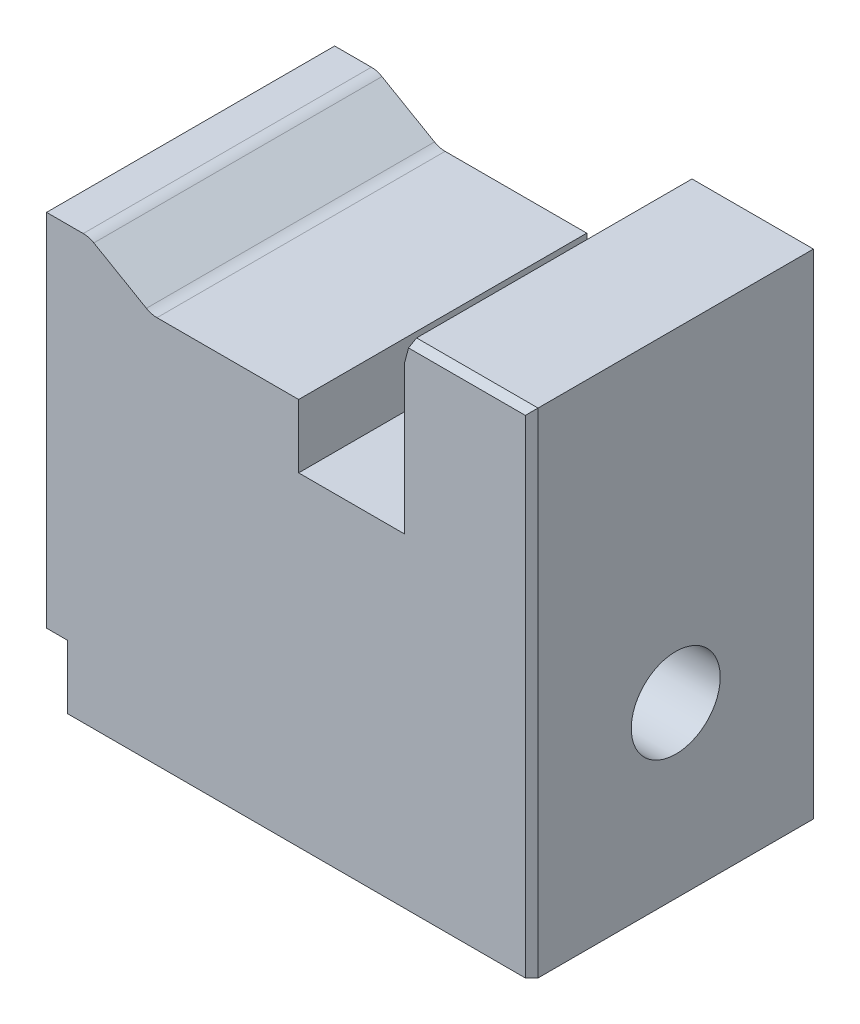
from build123d import *

# Parameters (mm, degrees)
EXTRUDE_1_DEPTH     = 13.6
M5X0_8_1_D          = 4.2
M5X0_8_1_DEPTH      = 12.4
M5X0_8_1_TIP        = 1.2618073
CHAMFER_1_SIZE      = 0.3
CHAMFER_2_SIZE      = 1
CHAMFER_2_SIZE2     = 0.267949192
SKETCH_12_W         = 21.621453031
SKETCH_12_H         = 9.517840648
CUT_EXTRUDE_7_DEPTH = 1


with BuildPart() as part:
    # Sketch 1 → Extrude 1 (new body)
    with BuildSketch(Plane.XY):
        with BuildLine():
            Line((0, 0), (22.9, 0))
            Line((22.9, 0), (22.9, 23.3))
            Line((22.9, 23.3), (16.9, 23.3))
            Line((16.9, 23.3), (16.9, 15.3))
            Line((16.9, 15.3), (11.9, 15.3))
            Line((11.9, 15.3), (11.9, 18.3))
            Line((11.9, 18.3), (5.212435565, 18.3))
            ThreePointArc((5.212435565, 18.3), (4.95361652, 18.334074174), (4.712435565, 18.433974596))
            Line((4.712435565, 18.433974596), (2.232050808, 19.866025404))
            ThreePointArc((2.232050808, 19.866025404), (1.990869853, 19.965925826), (1.732050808, 20))
            Line((1.732050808, 20), (0, 20))
            Line((0, 20), (0, 0))
        make_face()
    extrude(amount=EXTRUDE_1_DEPTH)

    # M5x0.8 _1
    with Locations(Plane(origin=(22.9, 0, 0), x_dir=(0, 0, -1), z_dir=(1, 0, 0))):
        with Locations((-6.8, 8)):
            Hole(M5X0_8_1_D / 2, depth=M5X0_8_1_DEPTH)
            with Locations((0, 0, -(M5X0_8_1_DEPTH + M5X0_8_1_TIP / 2))):  # 118° drill point
                Cone(0, M5X0_8_1_D / 2, M5X0_8_1_TIP, mode=Mode.SUBTRACT)

    # Chamfer 1
    chamfer_1_edges = [part.edges().sort_by_distance(p)[0] for p in [
        (22.9, 11.65, 13.6),
        (19.9, 23.3, 13.6),
        (19.9, 23.3, 0),
        (22.9, 11.65, 0),
    ]]
    chamfer(chamfer_1_edges, length=CHAMFER_1_SIZE)

    # Chamfer 2
    chamfer_2_edges = [part.edges().sort_by_distance(p)[0] for p in [
        (16.9, 23.3, 6.8),
    ]]
    chamfer_2_side = [part.faces().sort_by_distance(p)[0] for p in [
        (16.9, 19.296771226, 6.8),
    ]]
    chamfer(chamfer_2_edges, length=CHAMFER_2_SIZE, length2=CHAMFER_2_SIZE2, reference=chamfer_2_side[0])

    # Sketch 12 → Cut-Extrude 7 (cut)
    with BuildSketch(Plane.ZY):
        with Locations((6.453321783, -1.758920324)):
            Rectangle(SKETCH_12_W, SKETCH_12_H)
    extrude(amount=-CUT_EXTRUDE_7_DEPTH, mode=Mode.SUBTRACT)


solid = part.part
